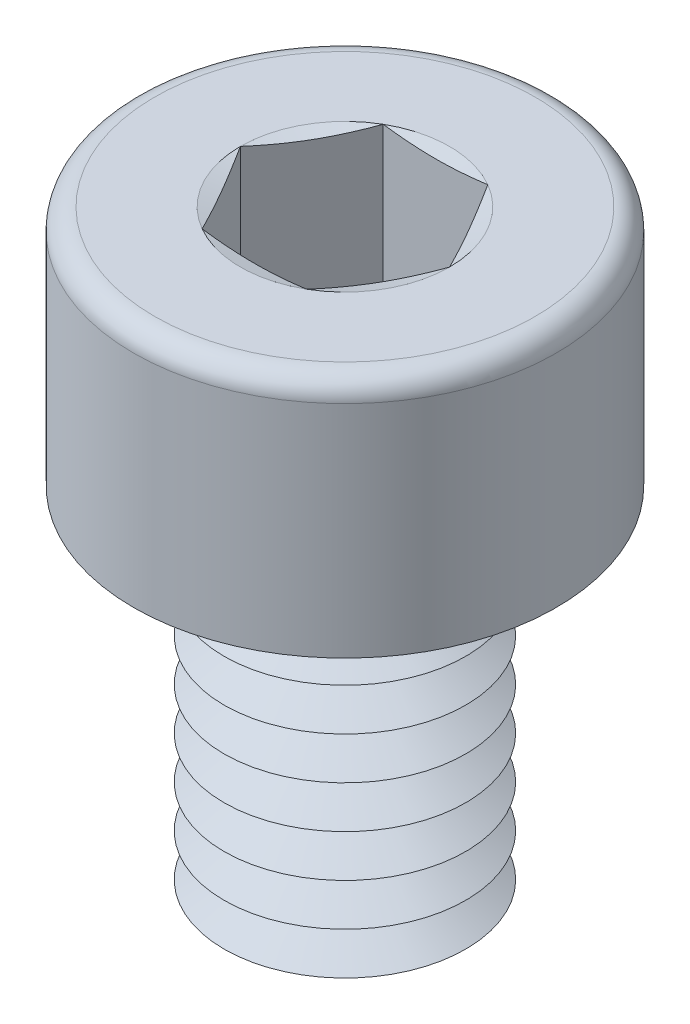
from build123d import *

# Parameters (mm, degrees)
SKETCH1_R       = 2
EXTRUDE1_DEPTH  = 6
SKETCH2_R       = 3.5
EXTRUDE2_DEPTH  = 4
EXTRUDE3_DEPTH  = 3
FILLET1_R       = 0.35
LPATTERN1_COUNT = 9
LPATTERN1_PITCH = 0.7


with BuildPart() as part:
    # Sketch1 → Extrude1 (new body)
    with BuildSketch(Plane(origin=(0, 0, 0), x_dir=(1, 0, 0), z_dir=(0, 1, 0))):
        with Locations(Location((0, 0, 0), (0, 0, 270))):
            Circle(SKETCH1_R)
    extrude(amount=EXTRUDE1_DEPTH)

    # Sketch2 → Extrude2 (add)
    with BuildSketch(Plane(origin=(0, 6, 0), x_dir=(1, 0, 0), z_dir=(0, 1, 0))):
        with Locations(Location((0, 0, 0), (0, 0, 270))):
            Circle(SKETCH2_R)
    extrude(amount=EXTRUDE2_DEPTH)

    # Sketch3 → Extrude3 (cut)
    with BuildSketch(Plane(origin=(0, 10, 0), x_dir=(1, 0, 0), z_dir=(0, 1, 0))):
        Polygon((0.866025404, 1.5), (-0.866025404, 1.5), (-1.732050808, 0), (-0.866025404, -1.5), (0.866025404, -1.5), (1.732050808, 0), align=None)
    extrude(amount=-EXTRUDE3_DEPTH, mode=Mode.SUBTRACT)

    # Fillet1
    fillet1_edges = [part.edges().sort_by_distance(p)[0] for p in [
        (0, 10, -3.5),
    ]]
    fillet(fillet1_edges, radius=FILLET1_R)

    # Sketch4 → Cut-Revolve1 (revolve, cut)
    with BuildSketch(Plane(origin=(0, 0, 0), x_dir=(0, 0, -1), z_dir=(1, 0, 0))):
        Polygon((-1.5, 7), (0, 7), (0, 6.133974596), align=None)
    revolve(axis=Axis((0, 7, 0), (0, -1, 0)), mode=Mode.SUBTRACT)

    # Sketch5 → Cut-Revolve2 (revolve, cut)
    with BuildSketch(Plane.XY, mode=Mode.PRIVATE) as cut_revolve2_sk:
        Polygon((-2, 0.35), (-2, -0.35), (-1.393782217, 0), align=None)
    cut_revolve2 = revolve(cut_revolve2_sk.sketch.rotate(Axis((0, 6, 0), (0, -1, 0)), 270), axis=Axis((0, 6, 0), (0, -1, 0)), mode=Mode.SUBTRACT)

    # LPattern1: Cut-Revolve2 ×9
    with Locations(*[(0, i * LPATTERN1_PITCH, 0) for i in range(1, LPATTERN1_COUNT)]):
        add(cut_revolve2, mode=Mode.SUBTRACT)

    # Extrude4 cone 1 section (on through the dimple's axis) → Extrude4 (revolve, cut)
    with BuildSketch(Plane(origin=(0, 10, 0), x_dir=(0, 0, 1), z_dir=(1, 0, 0))):
        Polygon((0, 0), (1.732050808, 0), (0, 0.464101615), align=None)
    revolve(axis=Axis((0, 10, 0), (0, -1, 0)), mode=Mode.SUBTRACT)


solid = part.part
